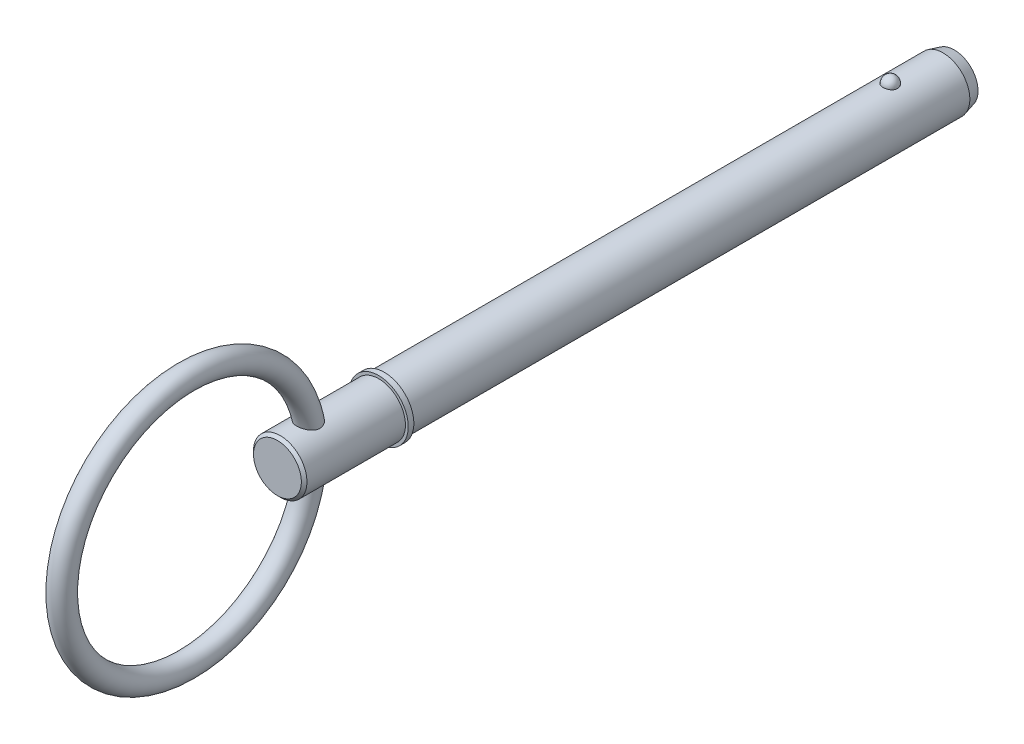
from build123d import *

# Parameters (mm, degrees)
SKETCH2_R           = 4.765
BOSS_EXTRUDE1_DEPTH = 88.9
BOSS_EXTRUDE2_START = 12.7
SKETCH3_R           = 4.765
BOSS_EXTRUDE2_DEPTH = 12.7
CHAMFER1_SIZE       = 2
CHAMFER1_SIZE2      = 0.535898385
SKETCH20_W          = 1
SKETCH20_H          = 5.265
SKETCH21_R          = 4.765
BOSS_EXTRUDE3_DEPTH = 19.05
CHAMFER2_SIZE       = 0.5
SKETCH24_R          = 2


with BuildPart() as part:
    # Sketch2 → Boss-Extrude1 (new body)
    with BuildSketch(Plane.XY):
        Circle(SKETCH2_R)
    extrude(amount=BOSS_EXTRUDE1_DEPTH)

    # Sketch3 → Boss-Extrude2 (add)
    with BuildSketch(Plane(origin=(0, 0, 0), x_dir=(-1, 0, 0), z_dir=(0, 0, -1)).offset(BOSS_EXTRUDE2_START)):
        Circle(SKETCH3_R)
    extrude(amount=-BOSS_EXTRUDE2_DEPTH)

    # Chamfer1
    chamfer1_edges = [part.edges().sort_by_distance(p)[0] for p in [
        (4.765, 0, -12.7),
    ]]
    chamfer1_side = [part.faces().sort_by_distance(p)[0] for p in [
        (4.765, 0, -6.35),
    ]]
    chamfer(chamfer1_edges, length=CHAMFER1_SIZE, length2=CHAMFER1_SIZE2, reference=chamfer1_side[0])

    # Sketch18 → Revolve1 (revolve)
    with BuildSketch(Plane(origin=(0, 0, 0), x_dir=(0, 0, -1), z_dir=(1, 0, 0))):
        with BuildLine():
            Line((1.29, 6.055), (1.29, 3.475))
            ThreePointArc((1.29, 3.475), (0, 4.765), (1.29, 6.055))
        make_face()
    revolve(axis=Axis((0, 6.055, -1.29), (0, -1, 0)))

    # Sketch20 → Revolve2 (revolve)
    with BuildSketch(Plane(origin=(0, 0, 0), x_dir=(0, 0, -1), z_dir=(1, 0, 0)), mode=Mode.PRIVATE) as revolve2_sk:
        with Locations((-89.4, 2.6325)):
            Rectangle(SKETCH20_W, SKETCH20_H)
    revolve(revolve2_sk.sketch.rotate(Axis((0, 0, 33.728787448), (0, 0, 1)), 90), axis=Axis((0, 0, 33.728787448), (0, 0, 1)))

    # Sketch21 → Boss-Extrude3 (add)
    with BuildSketch(Plane(origin=(0, 0, 88.9), x_dir=(-1, 0, 0), z_dir=(0, 0, -1))):
        Circle(SKETCH21_R)
    extrude(amount=-BOSS_EXTRUDE3_DEPTH)

    # Chamfer2
    chamfer2_edges = [part.edges().sort_by_distance(p)[0] for p in [
        (4.765, 0, 107.95),
    ]]
    chamfer(chamfer2_edges, length=CHAMFER2_SIZE)

    # Sweep1: sweep along a path in Sketch23
    with BuildLine(Plane(origin=(0, 0, 0), x_dir=(0, 0, -1), z_dir=(1, 0, 0))) as sweep1_path:
        CenterArc((-124.175, 0), 22.225, 0, 360)
    # Sketch24 → Sweep1 (sweep)
    with BuildSketch(Plane(origin=(0, 0, 0), x_dir=(1, 0, 0), z_dir=(0, 1, 0))):
        with Locations((0, -101.95)):
            Circle(SKETCH24_R)
    sweep(path=sweep1_path.line)


solid = part.part
